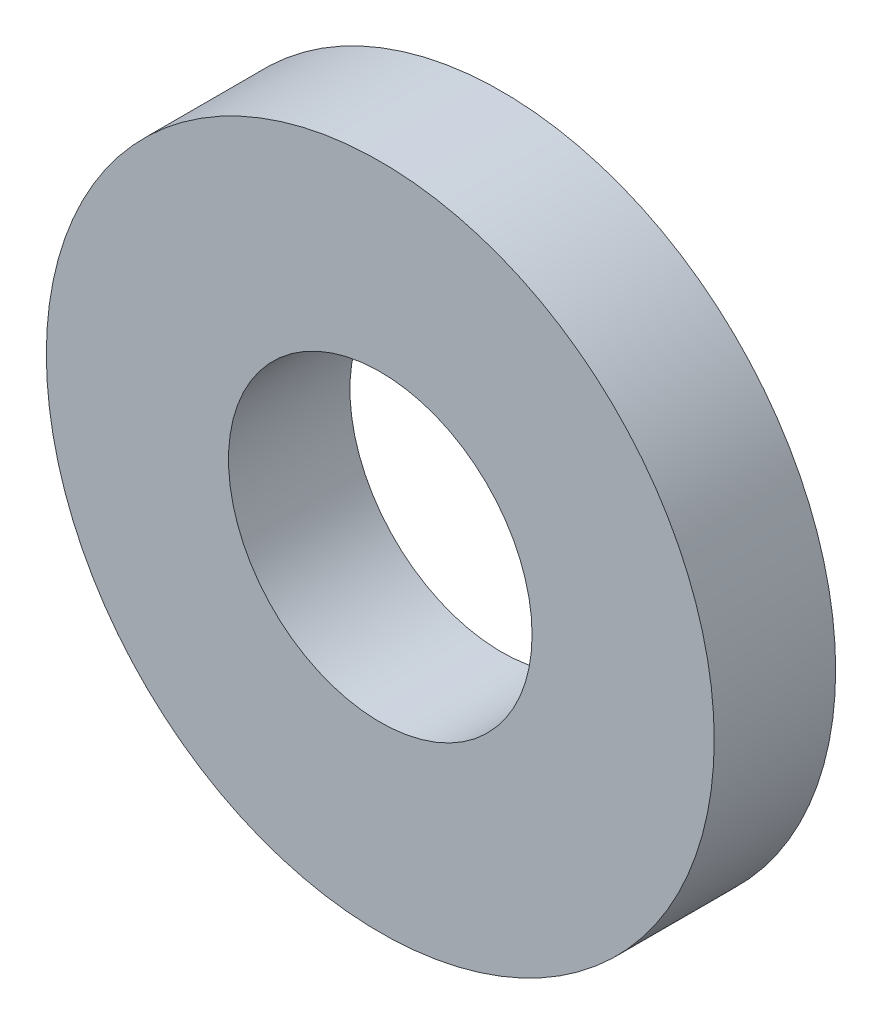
ISO-10303-21;
HEADER;
FILE_DESCRIPTION(('STEP AP214'),'2;1');
FILE_NAME('part.step','',(''),(''),'','','');
FILE_SCHEMA(('AUTOMOTIVE_DESIGN { 1 0 10303 214 1 1 1 1 }'));
ENDSEC;
DATA;
#1=APPLICATION_CONTEXT('core data for automotive mechanical design processes');
#2=APPLICATION_PROTOCOL_DEFINITION('international standard','automotive_design',2000,#1);
#3=PRODUCT_CONTEXT('',#1,'mechanical');
#4=PRODUCT('Part','Part','',(#3));
#5=PRODUCT_RELATED_PRODUCT_CATEGORY('part','',(#4));
#6=PRODUCT_DEFINITION_FORMATION('','',#4);
#7=PRODUCT_DEFINITION_CONTEXT('part definition',#1,'design');
#8=PRODUCT_DEFINITION('design','',#6,#7);
#9=PRODUCT_DEFINITION_SHAPE('','',#8);
#10=(LENGTH_UNIT() NAMED_UNIT(*) SI_UNIT(.MILLI.,.METRE.));
#11=(NAMED_UNIT(*) PLANE_ANGLE_UNIT() SI_UNIT($,.RADIAN.));
#12=(NAMED_UNIT(*) SI_UNIT($,.STERADIAN.) SOLID_ANGLE_UNIT());
#13=UNCERTAINTY_MEASURE_WITH_UNIT(LENGTH_MEASURE(1.E-05),#10,'distance_accuracy_value','');
#14=(GEOMETRIC_REPRESENTATION_CONTEXT(3) GLOBAL_UNCERTAINTY_ASSIGNED_CONTEXT((#13)) GLOBAL_UNIT_ASSIGNED_CONTEXT((#10,
#11,#12)) REPRESENTATION_CONTEXT('',''));
#15=CARTESIAN_POINT('',(0.,0.,0.));
#16=DIRECTION('',(0.,0.,1.));
#17=DIRECTION('',(1.,0.,0.));
#18=AXIS2_PLACEMENT_3D('',#15,#16,#17);
#19=CARTESIAN_POINT('',(0.243829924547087,0.,4.));
#20=DIRECTION('',(0.,0.,1.));
#21=DIRECTION('',(1.,0.,0.));
#22=AXIS2_PLACEMENT_3D('',#19,#20,#21);
#23=PLANE('',#22);
#24=CARTESIAN_POINT('',(0.243829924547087,0.,4.));
#25=DIRECTION('',(0.,0.,1.));
#26=DIRECTION('',(1.,0.,0.));
#27=AXIS2_PLACEMENT_3D('',#24,#25,#26);
#28=CIRCLE('',#27,11.);
#29=CARTESIAN_POINT('',(11.2438299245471,0.,4.));
#30=VERTEX_POINT('',#29);
#31=EDGE_CURVE('E10',#30,#30,#28,.T.);
#32=ORIENTED_EDGE('',*,*,#31,.T.);
#33=EDGE_LOOP('',(#32));
#34=FACE_BOUND('',#33,.T.);
#35=CARTESIAN_POINT('',(0.243829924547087,0.,4.));
#36=DIRECTION('',(0.,0.,1.));
#37=DIRECTION('',(1.,0.,0.));
#38=AXIS2_PLACEMENT_3D('',#35,#36,#37);
#39=CIRCLE('',#38,5.);
#40=CARTESIAN_POINT('',(5.24382992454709,0.,4.));
#41=VERTEX_POINT('',#40);
#42=EDGE_CURVE('E42',#41,#41,#39,.T.);
#43=ORIENTED_EDGE('',*,*,#42,.F.);
#44=EDGE_LOOP('',(#43));
#45=FACE_BOUND('',#44,.T.);
#46=ADVANCED_FACE('F31',(#34,#45),#23,.T.);
#47=CARTESIAN_POINT('',(0.243829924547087,0.,0.));
#48=DIRECTION('',(0.,0.,1.));
#49=DIRECTION('',(1.,0.,0.));
#50=AXIS2_PLACEMENT_3D('',#47,#48,#49);
#51=PLANE('',#50);
#52=CARTESIAN_POINT('',(0.243829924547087,0.,0.));
#53=DIRECTION('',(0.,0.,1.));
#54=DIRECTION('',(1.,0.,0.));
#55=AXIS2_PLACEMENT_3D('',#52,#53,#54);
#56=CIRCLE('',#55,11.);
#57=CARTESIAN_POINT('',(11.2438299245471,0.,0.));
#58=VERTEX_POINT('',#57);
#59=EDGE_CURVE('E35',#58,#58,#56,.T.);
#60=ORIENTED_EDGE('',*,*,#59,.F.);
#61=EDGE_LOOP('',(#60));
#62=FACE_BOUND('',#61,.T.);
#63=CARTESIAN_POINT('',(0.243829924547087,0.,0.));
#64=DIRECTION('',(0.,0.,1.));
#65=DIRECTION('',(1.,0.,0.));
#66=AXIS2_PLACEMENT_3D('',#63,#64,#65);
#67=CIRCLE('',#66,5.);
#68=CARTESIAN_POINT('',(5.24382992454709,0.,0.));
#69=VERTEX_POINT('',#68);
#70=EDGE_CURVE('E44',#69,#69,#67,.T.);
#71=ORIENTED_EDGE('',*,*,#70,.T.);
#72=EDGE_LOOP('',(#71));
#73=FACE_BOUND('',#72,.T.);
#74=ADVANCED_FACE('F54',(#62,#73),#51,.F.);
#75=CARTESIAN_POINT('',(0.243829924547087,0.,4.));
#76=DIRECTION('',(0.,0.,-1.));
#77=DIRECTION('',(-1.,0.,0.));
#78=AXIS2_PLACEMENT_3D('',#75,#76,#77);
#79=CYLINDRICAL_SURFACE('',#78,11.);
#80=ORIENTED_EDGE('',*,*,#31,.F.);
#81=EDGE_LOOP('',(#80));
#82=FACE_BOUND('',#81,.T.);
#83=ORIENTED_EDGE('',*,*,#59,.T.);
#84=EDGE_LOOP('',(#83));
#85=FACE_BOUND('',#84,.T.);
#86=ADVANCED_FACE('F33',(#82,#85),#79,.T.);
#87=CARTESIAN_POINT('',(0.243829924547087,0.,4.));
#88=DIRECTION('',(0.,0.,-1.));
#89=DIRECTION('',(-1.,0.,0.));
#90=AXIS2_PLACEMENT_3D('',#87,#88,#89);
#91=CYLINDRICAL_SURFACE('',#90,5.);
#92=ORIENTED_EDGE('',*,*,#42,.T.);
#93=EDGE_LOOP('',(#92));
#94=FACE_BOUND('',#93,.T.);
#95=ORIENTED_EDGE('',*,*,#70,.F.);
#96=EDGE_LOOP('',(#95));
#97=FACE_BOUND('',#96,.T.);
#98=ADVANCED_FACE('F50',(#94,#97),#91,.F.);
#99=CLOSED_SHELL('',(#46,#74,#86,#98));
#100=MANIFOLD_SOLID_BREP('B2',#99);
#101=ADVANCED_BREP_SHAPE_REPRESENTATION('',(#18,#100),#14);
#102=SHAPE_DEFINITION_REPRESENTATION(#9,#101);
ENDSEC;
END-ISO-10303-21;
